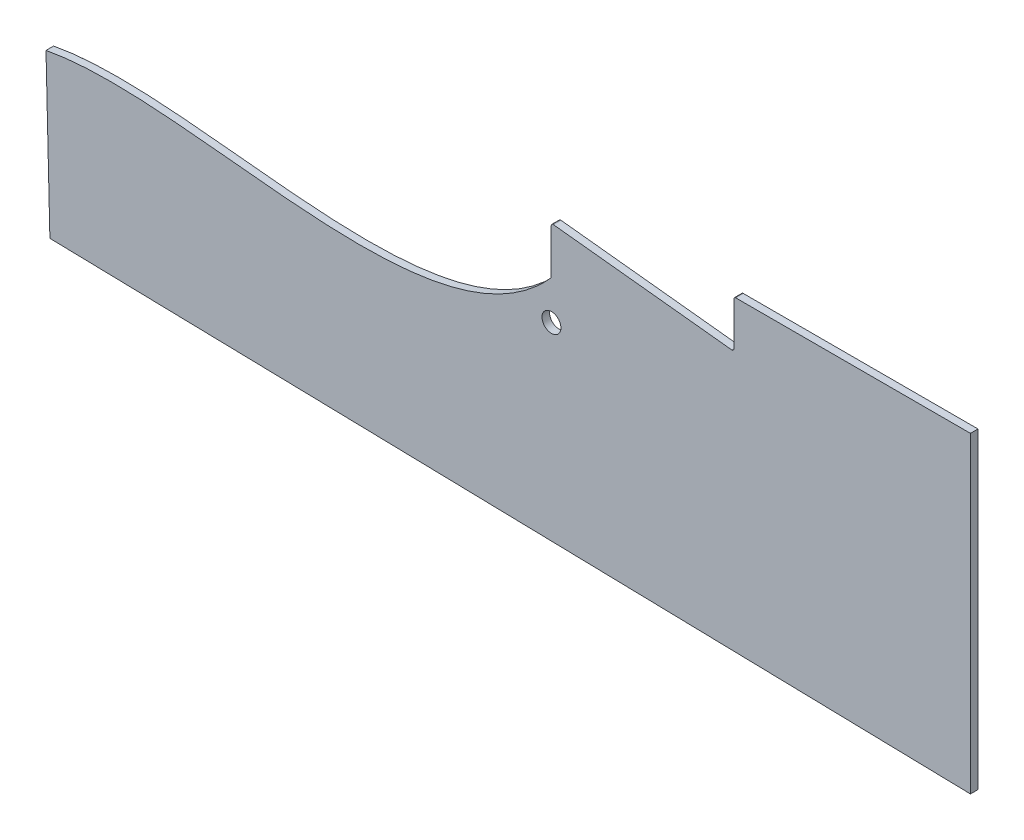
ISO-10303-21;
HEADER;
FILE_DESCRIPTION(('STEP AP214'),'2;1');
FILE_NAME('part.step','',(''),(''),'','','');
FILE_SCHEMA(('AUTOMOTIVE_DESIGN { 1 0 10303 214 1 1 1 1 }'));
ENDSEC;
DATA;
#1=APPLICATION_CONTEXT('core data for automotive mechanical design processes');
#2=APPLICATION_PROTOCOL_DEFINITION('international standard','automotive_design',2000,#1);
#3=PRODUCT_CONTEXT('',#1,'mechanical');
#4=PRODUCT('Part','Part','',(#3));
#5=PRODUCT_RELATED_PRODUCT_CATEGORY('part','',(#4));
#6=PRODUCT_DEFINITION_FORMATION('','',#4);
#7=PRODUCT_DEFINITION_CONTEXT('part definition',#1,'design');
#8=PRODUCT_DEFINITION('design','',#6,#7);
#9=PRODUCT_DEFINITION_SHAPE('','',#8);
#10=(LENGTH_UNIT() NAMED_UNIT(*) SI_UNIT(.MILLI.,.METRE.));
#11=(NAMED_UNIT(*) PLANE_ANGLE_UNIT() SI_UNIT($,.RADIAN.));
#12=(NAMED_UNIT(*) SI_UNIT($,.STERADIAN.) SOLID_ANGLE_UNIT());
#13=UNCERTAINTY_MEASURE_WITH_UNIT(LENGTH_MEASURE(1.E-05),#10,'distance_accuracy_value','');
#14=(GEOMETRIC_REPRESENTATION_CONTEXT(3) GLOBAL_UNCERTAINTY_ASSIGNED_CONTEXT((#13)) GLOBAL_UNIT_ASSIGNED_CONTEXT((#10,
#11,#12)) REPRESENTATION_CONTEXT('',''));
#15=CARTESIAN_POINT('',(0.,0.,0.));
#16=DIRECTION('',(0.,0.,1.));
#17=DIRECTION('',(1.,0.,0.));
#18=AXIS2_PLACEMENT_3D('',#15,#16,#17);
#19=CARTESIAN_POINT('',(-266.919232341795,115.836998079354,4.));
#20=DIRECTION('',(0.999707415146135,0.0241885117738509,0.));
#21=DIRECTION('',(-0.0241885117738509,0.999707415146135,0.));
#22=AXIS2_PLACEMENT_3D('',#19,#20,#21);
#23=PLANE('',#22);
#24=DIRECTION('',(0.0241885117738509,-0.999707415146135,0.));
#25=VECTOR('',#24,1.);
#26=CARTESIAN_POINT('',(-266.919232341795,115.836998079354,0.));
#27=LINE('',#26,#25);
#28=CARTESIAN_POINT('',(-266.919232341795,115.836998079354,0.));
#29=VERTEX_POINT('',#28);
#30=CARTESIAN_POINT('',(-264.863208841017,30.8618677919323,0.));
#31=VERTEX_POINT('',#30);
#32=EDGE_CURVE('E222',#29,#31,#27,.T.);
#33=ORIENTED_EDGE('',*,*,#32,.T.);
#34=DIRECTION('',(0.,0.,-1.));
#35=VECTOR('',#34,1.);
#36=CARTESIAN_POINT('',(-264.863208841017,30.8618677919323,4.));
#37=LINE('',#36,#35);
#38=CARTESIAN_POINT('',(-264.863208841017,30.8618677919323,4.));
#39=VERTEX_POINT('',#38);
#40=EDGE_CURVE('E205',#39,#31,#37,.T.);
#41=ORIENTED_EDGE('',*,*,#40,.F.);
#42=DIRECTION('',(0.0241885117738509,-0.999707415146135,0.));
#43=VECTOR('',#42,1.);
#44=CARTESIAN_POINT('',(-266.919232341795,115.836998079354,4.));
#45=LINE('',#44,#43);
#46=CARTESIAN_POINT('',(-266.919232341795,115.836998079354,4.));
#47=VERTEX_POINT('',#46);
#48=EDGE_CURVE('E212',#47,#39,#45,.T.);
#49=ORIENTED_EDGE('',*,*,#48,.F.);
#50=DIRECTION('',(0.,0.,-1.));
#51=VECTOR('',#50,1.);
#52=CARTESIAN_POINT('',(-266.919232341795,115.836998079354,4.));
#53=LINE('',#52,#51);
#54=EDGE_CURVE('E278',#47,#29,#53,.T.);
#55=ORIENTED_EDGE('',*,*,#54,.T.);
#56=EDGE_LOOP('',(#33,#41,#49,#55));
#57=FACE_BOUND('',#56,.T.);
#58=ADVANCED_FACE('F111',(#57),#23,.F.);
#59=CARTESIAN_POINT('',(-264.863208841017,30.8618677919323,4.));
#60=DIRECTION('',(0.0226957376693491,0.999742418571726,0.));
#61=DIRECTION('',(-0.999742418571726,0.0226957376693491,0.));
#62=AXIS2_PLACEMENT_3D('',#59,#60,#61);
#63=PLANE('',#62);
#64=DIRECTION('',(0.999742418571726,-0.0226957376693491,0.));
#65=VECTOR('',#64,1.);
#66=CARTESIAN_POINT('',(-264.863208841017,30.8618677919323,0.));
#67=LINE('',#66,#65);
#68=CARTESIAN_POINT('',(221.456080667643,19.8216490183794,0.));
#69=VERTEX_POINT('',#68);
#70=EDGE_CURVE('E470',#31,#69,#67,.T.);
#71=ORIENTED_EDGE('',*,*,#70,.T.);
#72=DIRECTION('',(0.,0.,-1.));
#73=VECTOR('',#72,1.);
#74=CARTESIAN_POINT('',(221.456080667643,19.8216490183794,4.));
#75=LINE('',#74,#73);
#76=CARTESIAN_POINT('',(221.456080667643,19.8216490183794,4.));
#77=VERTEX_POINT('',#76);
#78=EDGE_CURVE('E208',#77,#69,#75,.T.);
#79=ORIENTED_EDGE('',*,*,#78,.F.);
#80=DIRECTION('',(0.999742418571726,-0.0226957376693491,0.));
#81=VECTOR('',#80,1.);
#82=CARTESIAN_POINT('',(-264.863208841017,30.8618677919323,4.));
#83=LINE('',#82,#81);
#84=EDGE_CURVE('E201',#39,#77,#83,.T.);
#85=ORIENTED_EDGE('',*,*,#84,.F.);
#86=ORIENTED_EDGE('',*,*,#40,.T.);
#87=EDGE_LOOP('',(#71,#79,#85,#86));
#88=FACE_BOUND('',#87,.T.);
#89=ADVANCED_FACE('F203',(#88),#63,.F.);
#90=CARTESIAN_POINT('',(221.456080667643,19.8216490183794,4.));
#91=DIRECTION('',(-1.,0.,0.));
#92=DIRECTION('',(0.,0.,1.));
#93=AXIS2_PLACEMENT_3D('',#90,#91,#92);
#94=PLANE('',#93);
#95=DIRECTION('',(0.,1.,0.));
#96=VECTOR('',#95,1.);
#97=CARTESIAN_POINT('',(221.456080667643,19.8216490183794,0.));
#98=LINE('',#97,#96);
#99=CARTESIAN_POINT('',(221.456080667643,184.821649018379,0.));
#100=VERTEX_POINT('',#99);
#101=EDGE_CURVE('E469',#69,#100,#98,.T.);
#102=ORIENTED_EDGE('',*,*,#101,.T.);
#103=DIRECTION('',(0.,0.,-1.));
#104=VECTOR('',#103,1.);
#105=CARTESIAN_POINT('',(221.456080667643,184.821649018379,4.));
#106=LINE('',#105,#104);
#107=CARTESIAN_POINT('',(221.456080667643,184.821649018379,4.));
#108=VERTEX_POINT('',#107);
#109=EDGE_CURVE('E227',#108,#100,#106,.T.);
#110=ORIENTED_EDGE('',*,*,#109,.F.);
#111=DIRECTION('',(0.,1.,0.));
#112=VECTOR('',#111,1.);
#113=CARTESIAN_POINT('',(221.456080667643,19.8216490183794,4.));
#114=LINE('',#113,#112);
#115=EDGE_CURVE('E211',#77,#108,#114,.T.);
#116=ORIENTED_EDGE('',*,*,#115,.F.);
#117=ORIENTED_EDGE('',*,*,#78,.T.);
#118=EDGE_LOOP('',(#102,#110,#116,#117));
#119=FACE_BOUND('',#118,.T.);
#120=ADVANCED_FACE('F314',(#119),#94,.F.);
#121=CARTESIAN_POINT('',(96.4560806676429,184.821649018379,4.));
#122=DIRECTION('',(0.,1.,0.));
#123=DIRECTION('',(0.,0.,1.));
#124=AXIS2_PLACEMENT_3D('',#121,#122,#123);
#125=PLANE('',#124);
#126=DIRECTION('',(1.,0.,0.));
#127=VECTOR('',#126,1.);
#128=CARTESIAN_POINT('',(96.4560806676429,184.821649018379,0.));
#129=LINE('',#128,#127);
#130=CARTESIAN_POINT('',(97.4560806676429,184.821649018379,0.));
#131=VERTEX_POINT('',#130);
#132=EDGE_CURVE('E466',#131,#100,#129,.T.);
#133=ORIENTED_EDGE('',*,*,#132,.F.);
#134=DIRECTION('',(0.,0.,-1.));
#135=VECTOR('',#134,1.);
#136=CARTESIAN_POINT('',(97.4560806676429,184.821649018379,4.));
#137=LINE('',#136,#135);
#138=CARTESIAN_POINT('',(97.4560806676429,184.821649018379,4.));
#139=VERTEX_POINT('',#138);
#140=EDGE_CURVE('E242',#131,#139,#137,.F.);
#141=ORIENTED_EDGE('',*,*,#140,.T.);
#142=DIRECTION('',(1.,0.,0.));
#143=VECTOR('',#142,1.);
#144=CARTESIAN_POINT('',(96.4560806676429,184.821649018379,4.));
#145=LINE('',#144,#143);
#146=EDGE_CURVE('E346',#139,#108,#145,.T.);
#147=ORIENTED_EDGE('',*,*,#146,.T.);
#148=ORIENTED_EDGE('',*,*,#109,.T.);
#149=EDGE_LOOP('',(#133,#141,#147,#148));
#150=FACE_BOUND('',#149,.T.);
#151=ADVANCED_FACE('F310',(#150),#125,.T.);
#152=CARTESIAN_POINT('',(96.4560806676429,159.821649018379,4.));
#153=DIRECTION('',(-1.,0.,0.));
#154=DIRECTION('',(0.,0.,1.));
#155=AXIS2_PLACEMENT_3D('',#152,#153,#154);
#156=PLANE('',#155);
#157=DIRECTION('',(0.,1.,0.));
#158=VECTOR('',#157,1.);
#159=CARTESIAN_POINT('',(96.4560806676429,159.821649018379,4.));
#160=LINE('',#159,#158);
#161=CARTESIAN_POINT('',(96.4560806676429,160.935872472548,4.));
#162=VERTEX_POINT('',#161);
#163=CARTESIAN_POINT('',(96.4560806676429,183.821649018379,4.));
#164=VERTEX_POINT('',#163);
#165=EDGE_CURVE('E344',#162,#164,#160,.T.);
#166=ORIENTED_EDGE('',*,*,#165,.T.);
#167=DIRECTION('',(0.,0.,-1.));
#168=VECTOR('',#167,1.);
#169=CARTESIAN_POINT('',(96.4560806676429,183.821649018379,4.));
#170=LINE('',#169,#168);
#171=CARTESIAN_POINT('',(96.4560806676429,183.821649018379,0.));
#172=VERTEX_POINT('',#171);
#173=EDGE_CURVE('E225',#164,#172,#170,.T.);
#174=ORIENTED_EDGE('',*,*,#173,.T.);
#175=DIRECTION('',(0.,1.,0.));
#176=VECTOR('',#175,1.);
#177=CARTESIAN_POINT('',(96.4560806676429,159.821649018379,0.));
#178=LINE('',#177,#176);
#179=CARTESIAN_POINT('',(96.4560806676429,160.935872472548,0.));
#180=VERTEX_POINT('',#179);
#181=EDGE_CURVE('E472',#180,#172,#178,.T.);
#182=ORIENTED_EDGE('',*,*,#181,.F.);
#183=DIRECTION('',(0.,0.,-1.));
#184=VECTOR('',#183,1.);
#185=CARTESIAN_POINT('',(96.4560806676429,160.935872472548,4.));
#186=LINE('',#185,#184);
#187=EDGE_CURVE('E223',#180,#162,#186,.F.);
#188=ORIENTED_EDGE('',*,*,#187,.T.);
#189=EDGE_LOOP('',(#166,#174,#182,#188));
#190=FACE_BOUND('',#189,.T.);
#191=ADVANCED_FACE('F306',(#190),#156,.T.);
#192=CARTESIAN_POINT('',(96.4560806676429,159.821649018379,4.));
#193=DIRECTION('',(-0.107737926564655,-0.994179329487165,0.));
#194=DIRECTION('',(0.994179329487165,-0.107737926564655,0.));
#195=AXIS2_PLACEMENT_3D('',#192,#193,#194);
#196=PLANE('',#195);
#197=DIRECTION('',(-0.994179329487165,0.107737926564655,0.));
#198=VECTOR('',#197,1.);
#199=CARTESIAN_POINT('',(96.4560806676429,159.821649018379,4.));
#200=LINE('',#199,#198);
#201=CARTESIAN_POINT('',(95.3483427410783,159.941693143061,4.));
#202=VERTEX_POINT('',#201);
#203=CARTESIAN_POINT('',(1.10773792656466,170.154425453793,4.));
#204=VERTEX_POINT('',#203);
#205=EDGE_CURVE('E285',#202,#204,#200,.T.);
#206=ORIENTED_EDGE('',*,*,#205,.F.);
#207=DIRECTION('',(0.,0.,-1.));
#208=VECTOR('',#207,1.);
#209=CARTESIAN_POINT('',(95.3483427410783,159.941693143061,4.));
#210=LINE('',#209,#208);
#211=CARTESIAN_POINT('',(95.3483427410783,159.941693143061,0.));
#212=VERTEX_POINT('',#211);
#213=EDGE_CURVE('E250',#202,#212,#210,.T.);
#214=ORIENTED_EDGE('',*,*,#213,.T.);
#215=DIRECTION('',(-0.994179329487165,0.107737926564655,0.));
#216=VECTOR('',#215,1.);
#217=CARTESIAN_POINT('',(96.4560806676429,159.821649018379,0.));
#218=LINE('',#217,#216);
#219=CARTESIAN_POINT('',(1.10773792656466,170.154425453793,0.));
#220=VERTEX_POINT('',#219);
#221=EDGE_CURVE('E274',#212,#220,#218,.T.);
#222=ORIENTED_EDGE('',*,*,#221,.T.);
#223=DIRECTION('',(0.,0.,-1.));
#224=VECTOR('',#223,1.);
#225=CARTESIAN_POINT('',(1.10773792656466,170.154425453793,4.));
#226=LINE('',#225,#224);
#227=EDGE_CURVE('E248',#220,#204,#226,.F.);
#228=ORIENTED_EDGE('',*,*,#227,.T.);
#229=EDGE_LOOP('',(#206,#214,#222,#228));
#230=FACE_BOUND('',#229,.T.);
#231=ADVANCED_FACE('F303',(#230),#196,.F.);
#232=CARTESIAN_POINT('',(0.,170.274469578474,4.));
#233=DIRECTION('',(1.,0.,0.));
#234=DIRECTION('',(0.,1.,0.));
#235=AXIS2_PLACEMENT_3D('',#232,#233,#234);
#236=PLANE('',#235);
#237=DIRECTION('',(0.,-1.,0.));
#238=VECTOR('',#237,1.);
#239=CARTESIAN_POINT('',(0.,170.274469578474,4.));
#240=LINE('',#239,#238);
#241=CARTESIAN_POINT('',(0.,169.160246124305,4.));
#242=VERTEX_POINT('',#241);
#243=CARTESIAN_POINT('',(0.,145.657097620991,4.));
#244=VERTEX_POINT('',#243);
#245=EDGE_CURVE('E280',#242,#244,#240,.T.);
#246=ORIENTED_EDGE('',*,*,#245,.F.);
#247=DIRECTION('',(0.,0.,-1.));
#248=VECTOR('',#247,1.);
#249=CARTESIAN_POINT('',(0.,169.160246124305,4.));
#250=LINE('',#249,#248);
#251=CARTESIAN_POINT('',(0.,169.160246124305,0.));
#252=VERTEX_POINT('',#251);
#253=EDGE_CURVE('E254',#242,#252,#250,.T.);
#254=ORIENTED_EDGE('',*,*,#253,.T.);
#255=DIRECTION('',(0.,-1.,0.));
#256=VECTOR('',#255,1.);
#257=CARTESIAN_POINT('',(0.,170.274469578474,0.));
#258=LINE('',#257,#256);
#259=CARTESIAN_POINT('',(0.,145.657097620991,0.));
#260=VERTEX_POINT('',#259);
#261=EDGE_CURVE('E268',#252,#260,#258,.T.);
#262=ORIENTED_EDGE('',*,*,#261,.T.);
#263=DIRECTION('',(0.,0.,-1.));
#264=VECTOR('',#263,1.);
#265=CARTESIAN_POINT('',(0.,145.657097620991,4.));
#266=LINE('',#265,#264);
#267=EDGE_CURVE('E132',#260,#244,#266,.F.);
#268=ORIENTED_EDGE('',*,*,#267,.T.);
#269=EDGE_LOOP('',(#246,#254,#262,#268));
#270=FACE_BOUND('',#269,.T.);
#271=ADVANCED_FACE('F272',(#270),#236,.F.);
#272=CARTESIAN_POINT('',(-266.919232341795,115.836998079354,4.));
#273=CARTESIAN_POINT('',(-187.423838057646,131.051953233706,4.));
#274=CARTESIAN_POINT('',(-61.0568837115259,76.8967576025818,4.));
#275=CARTESIAN_POINT('',(0.,145.274469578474,4.));
#276=B_SPLINE_CURVE_WITH_KNOTS('',3,(#272,#273,#274,#275),.UNSPECIFIED.,.F.,.F.,(4,4),(0.,1.),.UNSPECIFIED.);
#277=DIRECTION('',(0.,0.,-1.));
#278=VECTOR('',#277,1.);
#279=SURFACE_OF_LINEAR_EXTRUSION('',#276,#278);
#280=CARTESIAN_POINT('',(-0.256748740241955,144.988085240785,4.));
#281=VERTEX_POINT('',#280);
#282=EDGE_CURVE('E217',#47,#281,#276,.T.);
#283=ORIENTED_EDGE('',*,*,#282,.T.);
#284=DIRECTION('',(0.,0.,-1.));
#285=VECTOR('',#284,1.);
#286=CARTESIAN_POINT('',(-0.256748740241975,144.988085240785,4.));
#287=LINE('',#286,#285);
#288=CARTESIAN_POINT('',(-0.256748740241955,144.988085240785,0.));
#289=VERTEX_POINT('',#288);
#290=EDGE_CURVE('E257',#281,#289,#287,.T.);
#291=ORIENTED_EDGE('',*,*,#290,.T.);
#292=CARTESIAN_POINT('',(-266.919232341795,115.836998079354,0.));
#293=CARTESIAN_POINT('',(-187.423838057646,131.051953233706,0.));
#294=CARTESIAN_POINT('',(-61.0568837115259,76.8967576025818,0.));
#295=CARTESIAN_POINT('',(0.,145.274469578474,0.));
#296=B_SPLINE_CURVE_WITH_KNOTS('',3,(#292,#293,#294,#295),.UNSPECIFIED.,.F.,.F.,(4,4),(0.,1.),.UNSPECIFIED.);
#297=EDGE_CURVE('E219',#29,#289,#296,.T.);
#298=ORIENTED_EDGE('',*,*,#297,.F.);
#299=ORIENTED_EDGE('',*,*,#54,.F.);
#300=EDGE_LOOP('',(#283,#291,#298,#299));
#301=FACE_BOUND('',#300,.T.);
#302=ADVANCED_FACE('F277',(#301),#279,.T.);
#303=CARTESIAN_POINT('',(-126.545174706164,110.619700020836,4.));
#304=DIRECTION('',(0.,0.,1.));
#305=DIRECTION('',(1.,0.,0.));
#306=AXIS2_PLACEMENT_3D('',#303,#304,#305);
#307=PLANE('',#306);
#308=CARTESIAN_POINT('',(0.114655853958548,124.872215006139,4.));
#309=DIRECTION('',(0.,0.,1.));
#310=DIRECTION('',(1.,0.,0.));
#311=AXIS2_PLACEMENT_3D('',#308,#309,#310);
#312=CIRCLE('',#311,5.);
#313=CARTESIAN_POINT('',(5.11465585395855,124.872215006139,4.));
#314=VERTEX_POINT('',#313);
#315=EDGE_CURVE('E234',#314,#314,#312,.T.);
#316=ORIENTED_EDGE('',*,*,#315,.F.);
#317=EDGE_LOOP('',(#316));
#318=FACE_BOUND('',#317,.T.);
#319=ORIENTED_EDGE('',*,*,#146,.F.);
#320=CARTESIAN_POINT('',(97.4560806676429,183.821649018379,4.));
#321=DIRECTION('',(0.,0.,1.));
#322=DIRECTION('',(1.,0.,0.));
#323=AXIS2_PLACEMENT_3D('',#320,#321,#322);
#324=CIRCLE('',#323,1.);
#325=EDGE_CURVE('E246',#139,#164,#324,.T.);
#326=ORIENTED_EDGE('',*,*,#325,.T.);
#327=ORIENTED_EDGE('',*,*,#165,.F.);
#328=CARTESIAN_POINT('',(95.4560806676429,160.935872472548,4.));
#329=DIRECTION('',(0.,0.,1.));
#330=DIRECTION('',(1.,0.,0.));
#331=AXIS2_PLACEMENT_3D('',#328,#329,#330);
#332=CIRCLE('',#331,1.);
#333=EDGE_CURVE('E262',#162,#202,#332,.F.);
#334=ORIENTED_EDGE('',*,*,#333,.T.);
#335=ORIENTED_EDGE('',*,*,#205,.T.);
#336=CARTESIAN_POINT('',(0.999999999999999,169.160246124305,4.));
#337=DIRECTION('',(0.,0.,1.));
#338=DIRECTION('',(1.,0.,0.));
#339=AXIS2_PLACEMENT_3D('',#336,#337,#338);
#340=CIRCLE('',#339,1.);
#341=EDGE_CURVE('E244',#204,#242,#340,.T.);
#342=ORIENTED_EDGE('',*,*,#341,.T.);
#343=ORIENTED_EDGE('',*,*,#245,.T.);
#344=CARTESIAN_POINT('',(-0.999999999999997,145.657097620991,4.));
#345=DIRECTION('',(0.,0.,1.));
#346=DIRECTION('',(1.,0.,0.));
#347=AXIS2_PLACEMENT_3D('',#344,#345,#346);
#348=CIRCLE('',#347,1.);
#349=EDGE_CURVE('E53',#244,#281,#348,.F.);
#350=ORIENTED_EDGE('',*,*,#349,.T.);
#351=ORIENTED_EDGE('',*,*,#282,.F.);
#352=ORIENTED_EDGE('',*,*,#48,.T.);
#353=ORIENTED_EDGE('',*,*,#84,.T.);
#354=ORIENTED_EDGE('',*,*,#115,.T.);
#355=EDGE_LOOP('',(#319,#326,#327,#334,#335,#342,#343,#350,#351,#352,#353,#354));
#356=FACE_BOUND('',#355,.T.);
#357=ADVANCED_FACE('F216',(#318,#356),#307,.T.);
#358=CARTESIAN_POINT('',(-126.545174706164,110.619700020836,0.));
#359=DIRECTION('',(0.,0.,1.));
#360=DIRECTION('',(1.,0.,0.));
#361=AXIS2_PLACEMENT_3D('',#358,#359,#360);
#362=PLANE('',#361);
#363=CARTESIAN_POINT('',(0.114655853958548,124.872215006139,0.));
#364=DIRECTION('',(0.,0.,1.));
#365=DIRECTION('',(1.,0.,0.));
#366=AXIS2_PLACEMENT_3D('',#363,#364,#365);
#367=CIRCLE('',#366,5.);
#368=CARTESIAN_POINT('',(5.11465585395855,124.872215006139,0.));
#369=VERTEX_POINT('',#368);
#370=EDGE_CURVE('E231',#369,#369,#367,.T.);
#371=ORIENTED_EDGE('',*,*,#370,.T.);
#372=EDGE_LOOP('',(#371));
#373=FACE_BOUND('',#372,.T.);
#374=ORIENTED_EDGE('',*,*,#181,.T.);
#375=CARTESIAN_POINT('',(97.4560806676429,183.821649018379,0.));
#376=DIRECTION('',(0.,0.,1.));
#377=DIRECTION('',(1.,0.,0.));
#378=AXIS2_PLACEMENT_3D('',#375,#376,#377);
#379=CIRCLE('',#378,1.);
#380=EDGE_CURVE('E240',#172,#131,#379,.F.);
#381=ORIENTED_EDGE('',*,*,#380,.T.);
#382=ORIENTED_EDGE('',*,*,#132,.T.);
#383=ORIENTED_EDGE('',*,*,#101,.F.);
#384=ORIENTED_EDGE('',*,*,#70,.F.);
#385=ORIENTED_EDGE('',*,*,#32,.F.);
#386=ORIENTED_EDGE('',*,*,#297,.T.);
#387=CARTESIAN_POINT('',(-0.999999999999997,145.657097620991,0.));
#388=DIRECTION('',(0.,0.,1.));
#389=DIRECTION('',(1.,0.,0.));
#390=AXIS2_PLACEMENT_3D('',#387,#388,#389);
#391=CIRCLE('',#390,1.);
#392=EDGE_CURVE('E119',#289,#260,#391,.T.);
#393=ORIENTED_EDGE('',*,*,#392,.T.);
#394=ORIENTED_EDGE('',*,*,#261,.F.);
#395=CARTESIAN_POINT('',(0.999999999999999,169.160246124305,0.));
#396=DIRECTION('',(0.,0.,1.));
#397=DIRECTION('',(1.,0.,0.));
#398=AXIS2_PLACEMENT_3D('',#395,#396,#397);
#399=CIRCLE('',#398,1.);
#400=EDGE_CURVE('E238',#252,#220,#399,.F.);
#401=ORIENTED_EDGE('',*,*,#400,.T.);
#402=ORIENTED_EDGE('',*,*,#221,.F.);
#403=CARTESIAN_POINT('',(95.4560806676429,160.935872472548,0.));
#404=DIRECTION('',(0.,0.,1.));
#405=DIRECTION('',(1.,0.,0.));
#406=AXIS2_PLACEMENT_3D('',#403,#404,#405);
#407=CIRCLE('',#406,1.);
#408=EDGE_CURVE('E260',#212,#180,#407,.T.);
#409=ORIENTED_EDGE('',*,*,#408,.T.);
#410=EDGE_LOOP('',(#374,#381,#382,#383,#384,#385,#386,#393,#394,#401,#402,#409));
#411=FACE_BOUND('',#410,.T.);
#412=ADVANCED_FACE('F267',(#373,#411),#362,.F.);
#413=CARTESIAN_POINT('',(0.114655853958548,124.872215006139,-6.));
#414=DIRECTION('',(0.,0.,1.));
#415=DIRECTION('',(1.,0.,0.));
#416=AXIS2_PLACEMENT_3D('',#413,#414,#415);
#417=CYLINDRICAL_SURFACE('',#416,5.);
#418=ORIENTED_EDGE('',*,*,#315,.T.);
#419=EDGE_LOOP('',(#418));
#420=FACE_BOUND('',#419,.T.);
#421=ORIENTED_EDGE('',*,*,#370,.F.);
#422=EDGE_LOOP('',(#421));
#423=FACE_BOUND('',#422,.T.);
#424=ADVANCED_FACE('F327',(#420,#423),#417,.F.);
#425=CARTESIAN_POINT('',(97.4560806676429,183.821649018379,4.));
#426=DIRECTION('',(0.,0.,-1.));
#427=DIRECTION('',(-1.,0.,0.));
#428=AXIS2_PLACEMENT_3D('',#425,#426,#427);
#429=CYLINDRICAL_SURFACE('',#428,1.);
#430=ORIENTED_EDGE('',*,*,#325,.F.);
#431=ORIENTED_EDGE('',*,*,#140,.F.);
#432=ORIENTED_EDGE('',*,*,#380,.F.);
#433=ORIENTED_EDGE('',*,*,#173,.F.);
#434=EDGE_LOOP('',(#430,#431,#432,#433));
#435=FACE_BOUND('',#434,.T.);
#436=ADVANCED_FACE('F323',(#435),#429,.T.);
#437=CARTESIAN_POINT('',(95.4560806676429,160.935872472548,4.));
#438=DIRECTION('',(0.,0.,-1.));
#439=DIRECTION('',(-1.,0.,0.));
#440=AXIS2_PLACEMENT_3D('',#437,#438,#439);
#441=CYLINDRICAL_SURFACE('',#440,1.);
#442=ORIENTED_EDGE('',*,*,#333,.F.);
#443=ORIENTED_EDGE('',*,*,#187,.F.);
#444=ORIENTED_EDGE('',*,*,#408,.F.);
#445=ORIENTED_EDGE('',*,*,#213,.F.);
#446=EDGE_LOOP('',(#442,#443,#444,#445));
#447=FACE_BOUND('',#446,.T.);
#448=ADVANCED_FACE('F326',(#447),#441,.F.);
#449=CARTESIAN_POINT('',(0.999999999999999,169.160246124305,4.));
#450=DIRECTION('',(0.,0.,-1.));
#451=DIRECTION('',(-1.,0.,0.));
#452=AXIS2_PLACEMENT_3D('',#449,#450,#451);
#453=CYLINDRICAL_SURFACE('',#452,1.);
#454=ORIENTED_EDGE('',*,*,#341,.F.);
#455=ORIENTED_EDGE('',*,*,#227,.F.);
#456=ORIENTED_EDGE('',*,*,#400,.F.);
#457=ORIENTED_EDGE('',*,*,#253,.F.);
#458=EDGE_LOOP('',(#454,#455,#456,#457));
#459=FACE_BOUND('',#458,.T.);
#460=ADVANCED_FACE('F330',(#459),#453,.T.);
#461=CARTESIAN_POINT('',(-0.999999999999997,145.657097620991,2.));
#462=DIRECTION('',(0.,0.,-1.));
#463=DIRECTION('',(-1.,0.,0.));
#464=AXIS2_PLACEMENT_3D('',#461,#462,#463);
#465=CYLINDRICAL_SURFACE('',#464,1.);
#466=ORIENTED_EDGE('',*,*,#349,.F.);
#467=ORIENTED_EDGE('',*,*,#267,.F.);
#468=ORIENTED_EDGE('',*,*,#392,.F.);
#469=ORIENTED_EDGE('',*,*,#290,.F.);
#470=EDGE_LOOP('',(#466,#467,#468,#469));
#471=FACE_BOUND('',#470,.T.);
#472=ADVANCED_FACE('F113',(#471),#465,.F.);
#473=CLOSED_SHELL('',(#58,#89,#120,#151,#191,#231,#271,#302,#357,#412,#424,#436,#448,#460,#472));
#474=MANIFOLD_SOLID_BREP('B6',#473);
#475=ADVANCED_BREP_SHAPE_REPRESENTATION('',(#18,#474),#14);
#476=SHAPE_DEFINITION_REPRESENTATION(#9,#475);
ENDSEC;
END-ISO-10303-21;
